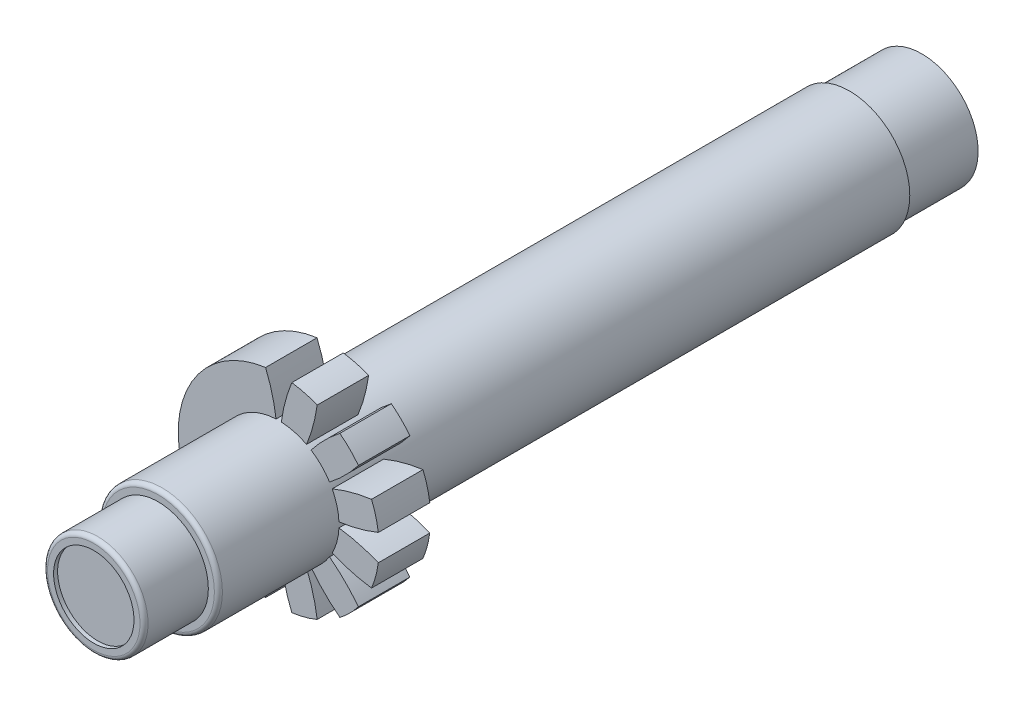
ISO-10303-21;
HEADER;
FILE_DESCRIPTION(('STEP AP214'),'2;1');
FILE_NAME('part.step','',(''),(''),'','','');
FILE_SCHEMA(('AUTOMOTIVE_DESIGN { 1 0 10303 214 1 1 1 1 }'));
ENDSEC;
DATA;
#1=APPLICATION_CONTEXT('core data for automotive mechanical design processes');
#2=APPLICATION_PROTOCOL_DEFINITION('international standard','automotive_design',2000,#1);
#3=PRODUCT_CONTEXT('',#1,'mechanical');
#4=PRODUCT('Part','Part','',(#3));
#5=PRODUCT_RELATED_PRODUCT_CATEGORY('part','',(#4));
#6=PRODUCT_DEFINITION_FORMATION('','',#4);
#7=PRODUCT_DEFINITION_CONTEXT('part definition',#1,'design');
#8=PRODUCT_DEFINITION('design','',#6,#7);
#9=PRODUCT_DEFINITION_SHAPE('','',#8);
#10=(LENGTH_UNIT() NAMED_UNIT(*) SI_UNIT(.MILLI.,.METRE.));
#11=(NAMED_UNIT(*) PLANE_ANGLE_UNIT() SI_UNIT($,.RADIAN.));
#12=(NAMED_UNIT(*) SI_UNIT($,.STERADIAN.) SOLID_ANGLE_UNIT());
#13=UNCERTAINTY_MEASURE_WITH_UNIT(LENGTH_MEASURE(1.E-05),#10,'distance_accuracy_value','');
#14=(GEOMETRIC_REPRESENTATION_CONTEXT(3) GLOBAL_UNCERTAINTY_ASSIGNED_CONTEXT((#13)) GLOBAL_UNIT_ASSIGNED_CONTEXT((#10,
#11,#12)) REPRESENTATION_CONTEXT('',''));
#15=CARTESIAN_POINT('',(0.,0.,0.));
#16=DIRECTION('',(0.,0.,1.));
#17=DIRECTION('',(1.,0.,0.));
#18=AXIS2_PLACEMENT_3D('',#15,#16,#17);
#19=CARTESIAN_POINT('',(0.,0.,-10.8712));
#20=DIRECTION('',(0.,0.,1.));
#21=DIRECTION('',(1.,0.,0.));
#22=AXIS2_PLACEMENT_3D('',#19,#20,#21);
#23=CYLINDRICAL_SURFACE('',#22,6.35);
#24=CARTESIAN_POINT('',(0.,0.,-10.8712));
#25=DIRECTION('',(0.,0.,1.));
#26=DIRECTION('',(1.,0.,0.));
#27=AXIS2_PLACEMENT_3D('',#24,#25,#26);
#28=CIRCLE('',#27,6.35);
#29=CARTESIAN_POINT('',(-0.828844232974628,6.29567448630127,-10.8712));
#30=VERTEX_POINT('',#29);
#31=CARTESIAN_POINT('',(-5.86663390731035,-2.43004250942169,-10.8712));
#32=VERTEX_POINT('',#31);
#33=EDGE_CURVE('E322',#30,#32,#28,.T.);
#34=ORIENTED_EDGE('',*,*,#33,.T.);
#35=DIRECTION('',(0.,0.,1.));
#36=VECTOR('',#35,1.);
#37=CARTESIAN_POINT('',(-5.86663390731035,-2.43004250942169,-48.26));
#38=LINE('',#37,#36);
#39=CARTESIAN_POINT('',(-5.86663390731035,-2.43004250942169,-7.62));
#40=VERTEX_POINT('',#39);
#41=EDGE_CURVE('E293',#32,#40,#38,.T.);
#42=ORIENTED_EDGE('',*,*,#41,.T.);
#43=CARTESIAN_POINT('',(0.,0.,-7.62));
#44=DIRECTION('',(0.,0.,1.));
#45=DIRECTION('',(1.,0.,0.));
#46=AXIS2_PLACEMENT_3D('',#43,#44,#45);
#47=CIRCLE('',#46,6.35);
#48=CARTESIAN_POINT('',(-0.828844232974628,6.29567448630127,-7.62));
#49=VERTEX_POINT('',#48);
#50=EDGE_CURVE('E311',#49,#40,#47,.T.);
#51=ORIENTED_EDGE('',*,*,#50,.F.);
#52=DIRECTION('',(0.,0.,1.));
#53=VECTOR('',#52,1.);
#54=CARTESIAN_POINT('',(-0.828844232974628,6.29567448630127,-48.26));
#55=LINE('',#54,#53);
#56=EDGE_CURVE('E584',#30,#49,#55,.T.);
#57=ORIENTED_EDGE('',*,*,#56,.F.);
#58=EDGE_LOOP('',(#34,#42,#51,#57));
#59=FACE_BOUND('',#58,.T.);
#60=ADVANCED_FACE('F29',(#59),#23,.T.);
#61=CARTESIAN_POINT('',(0.,0.,-10.8712));
#62=DIRECTION('',(0.,0.,1.));
#63=DIRECTION('',(1.,0.,0.));
#64=AXIS2_PLACEMENT_3D('',#61,#62,#63);
#65=PLANE('',#64);
#66=CARTESIAN_POINT('',(-7.20534714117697,7.47994471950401,-10.8712));
#67=DIRECTION('',(0.,0.,1.));
#68=DIRECTION('',(1.,0.,0.));
#69=AXIS2_PLACEMENT_3D('',#66,#67,#68);
#70=CIRCLE('',#69,10.);
#71=CARTESIAN_POINT('',(-3.37951046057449,-1.75926377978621,-10.8712));
#72=VERTEX_POINT('',#71);
#73=EDGE_CURVE('E304',#32,#72,#70,.T.);
#74=ORIENTED_EDGE('',*,*,#73,.F.);
#75=ORIENTED_EDGE('',*,*,#33,.F.);
#76=CARTESIAN_POINT('',(-10.0804980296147,2.500031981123,-10.8712));
#77=DIRECTION('',(0.,0.,1.));
#78=DIRECTION('',(1.,0.,0.));
#79=AXIS2_PLACEMENT_3D('',#76,#77,#78);
#80=CIRCLE('',#79,10.);
#81=CARTESIAN_POINT('',(-0.166191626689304,3.80637364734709,-10.8712));
#82=VERTEX_POINT('',#81);
#83=EDGE_CURVE('E320',#30,#82,#80,.F.);
#84=ORIENTED_EDGE('',*,*,#83,.T.);
#85=CARTESIAN_POINT('',(0.,0.,-10.8712));
#86=DIRECTION('',(0.,0.,1.));
#87=DIRECTION('',(1.,0.,0.));
#88=AXIS2_PLACEMENT_3D('',#85,#86,#87);
#89=CIRCLE('',#88,3.81);
#90=EDGE_CURVE('E325',#72,#82,#89,.F.);
#91=ORIENTED_EDGE('',*,*,#90,.F.);
#92=EDGE_LOOP('',(#74,#75,#84,#91));
#93=FACE_BOUND('',#92,.T.);
#94=ADVANCED_FACE('F414',(#93),#65,.F.);
#95=CARTESIAN_POINT('',(0.,0.,-7.62));
#96=DIRECTION('',(0.,0.,1.));
#97=DIRECTION('',(1.,0.,0.));
#98=AXIS2_PLACEMENT_3D('',#95,#96,#97);
#99=PLANE('',#98);
#100=ORIENTED_EDGE('',*,*,#50,.T.);
#101=CARTESIAN_POINT('',(-7.20534714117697,7.47994471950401,-7.62));
#102=DIRECTION('',(0.,0.,1.));
#103=DIRECTION('',(-0.499999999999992,0.866025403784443,0.));
#104=AXIS2_PLACEMENT_3D('',#101,#102,#103);
#105=CIRCLE('',#104,10.);
#106=CARTESIAN_POINT('',(-3.37951046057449,-1.75926377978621,-7.62));
#107=VERTEX_POINT('',#106);
#108=EDGE_CURVE('E728',#40,#107,#105,.T.);
#109=ORIENTED_EDGE('',*,*,#108,.T.);
#110=CARTESIAN_POINT('',(0.,0.,-7.62));
#111=DIRECTION('',(0.,0.,1.));
#112=DIRECTION('',(1.,0.,0.));
#113=AXIS2_PLACEMENT_3D('',#110,#111,#112);
#114=CIRCLE('',#113,3.81);
#115=CARTESIAN_POINT('',(-0.166191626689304,3.80637364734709,-7.62));
#116=VERTEX_POINT('',#115);
#117=EDGE_CURVE('E39',#107,#116,#114,.F.);
#118=ORIENTED_EDGE('',*,*,#117,.T.);
#119=CARTESIAN_POINT('',(-10.0804980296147,2.500031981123,-7.62));
#120=DIRECTION('',(0.,0.,-1.));
#121=DIRECTION('',(-1.,0.,0.));
#122=AXIS2_PLACEMENT_3D('',#119,#120,#121);
#123=CIRCLE('',#122,10.);
#124=EDGE_CURVE('E597',#49,#116,#123,.T.);
#125=ORIENTED_EDGE('',*,*,#124,.F.);
#126=EDGE_LOOP('',(#100,#109,#118,#125));
#127=FACE_BOUND('',#126,.T.);
#128=ADVANCED_FACE('F421',(#127),#99,.T.);
#129=DIRECTION('',(0.,0.,1.));
#130=VECTOR('',#129,1.);
#131=CARTESIAN_POINT('',(-5.03779192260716,-3.86563740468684,-48.26));
#132=LINE('',#131,#130);
#133=CARTESIAN_POINT('',(-5.03779192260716,-3.86563740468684,-10.8712));
#134=VERTEX_POINT('',#133);
#135=CARTESIAN_POINT('',(-5.03779192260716,-3.86563740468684,-7.62));
#136=VERTEX_POINT('',#135);
#137=EDGE_CURVE('E286',#134,#136,#132,.T.);
#138=ORIENTED_EDGE('',*,*,#137,.F.);
#139=CARTESIAN_POINT('',(-3.86563274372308,-5.03779549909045,-10.8712));
#140=VERTEX_POINT('',#139);
#141=EDGE_CURVE('E326',#134,#140,#28,.T.);
#142=ORIENTED_EDGE('',*,*,#141,.T.);
#143=DIRECTION('',(0.,0.,1.));
#144=VECTOR('',#143,1.);
#145=CARTESIAN_POINT('',(-3.86563274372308,-5.03779549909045,-48.26));
#146=LINE('',#145,#144);
#147=CARTESIAN_POINT('',(-3.86563274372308,-5.03779549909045,-7.62));
#148=VERTEX_POINT('',#147);
#149=EDGE_CURVE('E310',#140,#148,#146,.T.);
#150=ORIENTED_EDGE('',*,*,#149,.T.);
#151=EDGE_CURVE('E300',#136,#148,#47,.T.);
#152=ORIENTED_EDGE('',*,*,#151,.F.);
#153=EDGE_LOOP('',(#138,#142,#150,#152));
#154=FACE_BOUND('',#153,.T.);
#155=ADVANCED_FACE('F308',(#154),#23,.T.);
#156=ORIENTED_EDGE('',*,*,#141,.F.);
#157=CARTESIAN_POINT('',(2.87515780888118,-9.97998336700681,-10.8712));
#158=DIRECTION('',(0.,0.,1.));
#159=DIRECTION('',(1.,0.,0.));
#160=AXIS2_PLACEMENT_3D('',#157,#158,#159);
#161=CIRCLE('',#160,10.);
#162=CARTESIAN_POINT('',(-3.21332046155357,-2.04711299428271,-10.8712));
#163=VERTEX_POINT('',#162);
#164=EDGE_CURVE('E289',#134,#163,#161,.F.);
#165=ORIENTED_EDGE('',*,*,#164,.T.);
#166=CARTESIAN_POINT('',(-2.04711002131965,-3.21332235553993,-10.8712));
#167=VERTEX_POINT('',#166);
#168=EDGE_CURVE('E746',#167,#163,#89,.F.);
#169=ORIENTED_EDGE('',*,*,#168,.F.);
#170=CARTESIAN_POINT('',(-9.97998602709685,2.87514857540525,-10.8712));
#171=DIRECTION('',(0.,0.,1.));
#172=DIRECTION('',(1.,0.,0.));
#173=AXIS2_PLACEMENT_3D('',#170,#171,#172);
#174=CIRCLE('',#173,10.);
#175=EDGE_CURVE('E538',#140,#167,#174,.T.);
#176=ORIENTED_EDGE('',*,*,#175,.F.);
#177=EDGE_LOOP('',(#156,#165,#169,#176));
#178=FACE_BOUND('',#177,.T.);
#179=ADVANCED_FACE('F424',(#178),#65,.F.);
#180=CARTESIAN_POINT('',(2.87515780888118,-9.97998336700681,-7.62));
#181=DIRECTION('',(0.,0.,-1.));
#182=DIRECTION('',(0.499999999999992,-0.866025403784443,0.));
#183=AXIS2_PLACEMENT_3D('',#180,#181,#182);
#184=CIRCLE('',#183,10.);
#185=CARTESIAN_POINT('',(-3.21332046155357,-2.04711299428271,-7.62));
#186=VERTEX_POINT('',#185);
#187=EDGE_CURVE('E46',#136,#186,#184,.T.);
#188=ORIENTED_EDGE('',*,*,#187,.F.);
#189=ORIENTED_EDGE('',*,*,#151,.T.);
#190=CARTESIAN_POINT('',(-9.97998602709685,2.87514857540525,-7.62));
#191=DIRECTION('',(0.,0.,1.));
#192=DIRECTION('',(-0.866025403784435,0.500000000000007,0.));
#193=AXIS2_PLACEMENT_3D('',#190,#191,#192);
#194=CIRCLE('',#193,10.);
#195=CARTESIAN_POINT('',(-2.04711002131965,-3.21332235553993,-7.62));
#196=VERTEX_POINT('',#195);
#197=EDGE_CURVE('E723',#148,#196,#194,.T.);
#198=ORIENTED_EDGE('',*,*,#197,.T.);
#199=EDGE_CURVE('E303',#196,#186,#114,.F.);
#200=ORIENTED_EDGE('',*,*,#199,.T.);
#201=EDGE_LOOP('',(#188,#189,#198,#200));
#202=FACE_BOUND('',#201,.T.);
#203=ADVANCED_FACE('F298',(#202),#99,.T.);
#204=DIRECTION('',(0.,0.,1.));
#205=VECTOR('',#204,1.);
#206=CARTESIAN_POINT('',(-2.43003708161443,-5.86663615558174,-48.26));
#207=LINE('',#206,#205);
#208=CARTESIAN_POINT('',(-2.43003708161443,-5.86663615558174,-10.8712));
#209=VERTEX_POINT('',#208);
#210=CARTESIAN_POINT('',(-2.43003708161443,-5.86663615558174,-7.62));
#211=VERTEX_POINT('',#210);
#212=EDGE_CURVE('E716',#209,#211,#207,.T.);
#213=ORIENTED_EDGE('',*,*,#212,.F.);
#214=CARTESIAN_POINT('',(-0.828838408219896,-6.29567525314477,-10.8712));
#215=VERTEX_POINT('',#214);
#216=EDGE_CURVE('E539',#209,#215,#28,.T.);
#217=ORIENTED_EDGE('',*,*,#216,.T.);
#218=DIRECTION('',(0.,0.,1.));
#219=VECTOR('',#218,1.);
#220=CARTESIAN_POINT('',(-0.828838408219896,-6.29567525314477,-48.26));
#221=LINE('',#220,#219);
#222=CARTESIAN_POINT('',(-0.828838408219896,-6.29567525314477,-7.62));
#223=VERTEX_POINT('',#222);
#224=EDGE_CURVE('E700',#215,#223,#221,.T.);
#225=ORIENTED_EDGE('',*,*,#224,.T.);
#226=EDGE_CURVE('E312',#211,#223,#47,.T.);
#227=ORIENTED_EDGE('',*,*,#226,.F.);
#228=EDGE_LOOP('',(#213,#217,#225,#227));
#229=FACE_BOUND('',#228,.T.);
#230=ADVANCED_FACE('F428',(#229),#23,.T.);
#231=ORIENTED_EDGE('',*,*,#216,.F.);
#232=CARTESIAN_POINT('',(7.47995138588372,-7.20534022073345,-10.8712));
#233=DIRECTION('',(0.,0.,1.));
#234=DIRECTION('',(1.,0.,0.));
#235=AXIS2_PLACEMENT_3D('',#232,#233,#234);
#236=CIRCLE('',#235,10.);
#237=CARTESIAN_POINT('',(-1.75926065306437,-3.37951208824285,-10.8712));
#238=VERTEX_POINT('',#237);
#239=EDGE_CURVE('E712',#209,#238,#236,.F.);
#240=ORIENTED_EDGE('',*,*,#239,.T.);
#241=CARTESIAN_POINT('',(-0.166188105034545,-3.80637380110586,-10.8712));
#242=VERTEX_POINT('',#241);
#243=EDGE_CURVE('E747',#242,#238,#89,.F.);
#244=ORIENTED_EDGE('',*,*,#243,.F.);
#245=CARTESIAN_POINT('',(-10.0804957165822,-2.50004130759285,-10.8712));
#246=DIRECTION('',(0.,0.,1.));
#247=DIRECTION('',(1.,0.,0.));
#248=AXIS2_PLACEMENT_3D('',#245,#246,#247);
#249=CIRCLE('',#248,10.);
#250=EDGE_CURVE('E696',#215,#242,#249,.T.);
#251=ORIENTED_EDGE('',*,*,#250,.F.);
#252=EDGE_LOOP('',(#231,#240,#244,#251));
#253=FACE_BOUND('',#252,.T.);
#254=ADVANCED_FACE('F516',(#253),#65,.F.);
#255=CARTESIAN_POINT('',(7.47995138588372,-7.20534022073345,-7.62));
#256=DIRECTION('',(0.,0.,-1.));
#257=DIRECTION('',(0.866025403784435,-0.500000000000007,0.));
#258=AXIS2_PLACEMENT_3D('',#255,#256,#257);
#259=CIRCLE('',#258,10.);
#260=CARTESIAN_POINT('',(-1.75926065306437,-3.37951208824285,-7.62));
#261=VERTEX_POINT('',#260);
#262=EDGE_CURVE('E54',#211,#261,#259,.T.);
#263=ORIENTED_EDGE('',*,*,#262,.F.);
#264=ORIENTED_EDGE('',*,*,#226,.T.);
#265=CARTESIAN_POINT('',(-10.0804957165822,-2.50004130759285,-7.62));
#266=DIRECTION('',(0.,0.,1.));
#267=DIRECTION('',(-1.,0.,0.));
#268=AXIS2_PLACEMENT_3D('',#265,#266,#267);
#269=CIRCLE('',#268,10.);
#270=CARTESIAN_POINT('',(-0.166188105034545,-3.80637380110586,-7.62));
#271=VERTEX_POINT('',#270);
#272=EDGE_CURVE('E707',#223,#271,#269,.T.);
#273=ORIENTED_EDGE('',*,*,#272,.T.);
#274=EDGE_CURVE('E928',#271,#261,#114,.F.);
#275=ORIENTED_EDGE('',*,*,#274,.T.);
#276=EDGE_LOOP('',(#263,#264,#273,#275));
#277=FACE_BOUND('',#276,.T.);
#278=ADVANCED_FACE('F508',(#277),#99,.T.);
#279=DIRECTION('',(0.,0.,1.));
#280=VECTOR('',#279,1.);
#281=CARTESIAN_POINT('',(0.828844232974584,-6.29567448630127,-48.26));
#282=LINE('',#281,#280);
#283=CARTESIAN_POINT('',(0.828844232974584,-6.29567448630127,-10.8712));
#284=VERTEX_POINT('',#283);
#285=CARTESIAN_POINT('',(0.828844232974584,-6.29567448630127,-7.62));
#286=VERTEX_POINT('',#285);
#287=EDGE_CURVE('E698',#284,#286,#282,.T.);
#288=ORIENTED_EDGE('',*,*,#287,.F.);
#289=CARTESIAN_POINT('',(2.43004250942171,-5.86663390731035,-10.8712));
#290=VERTEX_POINT('',#289);
#291=EDGE_CURVE('E540',#284,#290,#28,.T.);
#292=ORIENTED_EDGE('',*,*,#291,.T.);
#293=DIRECTION('',(0.,0.,1.));
#294=VECTOR('',#293,1.);
#295=CARTESIAN_POINT('',(2.43004250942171,-5.86663390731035,-48.26));
#296=LINE('',#295,#294);
#297=CARTESIAN_POINT('',(2.43004250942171,-5.86663390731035,-7.62));
#298=VERTEX_POINT('',#297);
#299=EDGE_CURVE('E685',#290,#298,#296,.T.);
#300=ORIENTED_EDGE('',*,*,#299,.T.);
#301=EDGE_CURVE('E317',#286,#298,#47,.T.);
#302=ORIENTED_EDGE('',*,*,#301,.F.);
#303=EDGE_LOOP('',(#288,#292,#300,#302));
#304=FACE_BOUND('',#303,.T.);
#305=ADVANCED_FACE('F514',(#304),#23,.T.);
#306=ORIENTED_EDGE('',*,*,#291,.F.);
#307=CARTESIAN_POINT('',(10.0804980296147,-2.50003198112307,-10.8712));
#308=DIRECTION('',(0.,0.,1.));
#309=DIRECTION('',(1.,0.,0.));
#310=AXIS2_PLACEMENT_3D('',#307,#308,#309);
#311=CIRCLE('',#310,10.);
#312=CARTESIAN_POINT('',(0.166191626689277,-3.80637364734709,-10.8712));
#313=VERTEX_POINT('',#312);
#314=EDGE_CURVE('E690',#284,#313,#311,.F.);
#315=ORIENTED_EDGE('',*,*,#314,.T.);
#316=CARTESIAN_POINT('',(1.75926377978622,-3.37951046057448,-10.8712));
#317=VERTEX_POINT('',#316);
#318=EDGE_CURVE('E766',#317,#313,#89,.F.);
#319=ORIENTED_EDGE('',*,*,#318,.F.);
#320=CARTESIAN_POINT('',(-7.47994471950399,-7.20534714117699,-10.8712));
#321=DIRECTION('',(0.,0.,1.));
#322=DIRECTION('',(1.,0.,0.));
#323=AXIS2_PLACEMENT_3D('',#320,#321,#322);
#324=CIRCLE('',#323,10.);
#325=EDGE_CURVE('E677',#290,#317,#324,.T.);
#326=ORIENTED_EDGE('',*,*,#325,.F.);
#327=EDGE_LOOP('',(#306,#315,#319,#326));
#328=FACE_BOUND('',#327,.T.);
#329=ADVANCED_FACE('F504',(#328),#65,.F.);
#330=CARTESIAN_POINT('',(10.0804980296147,-2.50003198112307,-7.62));
#331=DIRECTION('',(0.,0.,-1.));
#332=DIRECTION('',(1.,0.,0.));
#333=AXIS2_PLACEMENT_3D('',#330,#331,#332);
#334=CIRCLE('',#333,10.);
#335=CARTESIAN_POINT('',(0.166191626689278,-3.80637364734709,-7.62));
#336=VERTEX_POINT('',#335);
#337=EDGE_CURVE('E710',#286,#336,#334,.T.);
#338=ORIENTED_EDGE('',*,*,#337,.F.);
#339=ORIENTED_EDGE('',*,*,#301,.T.);
#340=CARTESIAN_POINT('',(-7.47994471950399,-7.20534714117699,-7.62));
#341=DIRECTION('',(0.,0.,1.));
#342=DIRECTION('',(-0.866025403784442,-0.499999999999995,0.));
#343=AXIS2_PLACEMENT_3D('',#340,#341,#342);
#344=CIRCLE('',#343,10.);
#345=CARTESIAN_POINT('',(1.75926377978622,-3.37951046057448,-7.62));
#346=VERTEX_POINT('',#345);
#347=EDGE_CURVE('E682',#298,#346,#344,.T.);
#348=ORIENTED_EDGE('',*,*,#347,.T.);
#349=EDGE_CURVE('E929',#346,#336,#114,.F.);
#350=ORIENTED_EDGE('',*,*,#349,.T.);
#351=EDGE_LOOP('',(#338,#339,#348,#350));
#352=FACE_BOUND('',#351,.T.);
#353=ADVANCED_FACE('F496',(#352),#99,.T.);
#354=DIRECTION('',(0.,0.,1.));
#355=VECTOR('',#354,1.);
#356=CARTESIAN_POINT('',(3.86563740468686,-5.03779192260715,-48.26));
#357=LINE('',#356,#355);
#358=CARTESIAN_POINT('',(3.86563740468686,-5.03779192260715,-10.8712));
#359=VERTEX_POINT('',#358);
#360=CARTESIAN_POINT('',(3.86563740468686,-5.03779192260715,-7.62));
#361=VERTEX_POINT('',#360);
#362=EDGE_CURVE('E689',#359,#361,#357,.T.);
#363=ORIENTED_EDGE('',*,*,#362,.F.);
#364=CARTESIAN_POINT('',(5.03779549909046,-3.86563274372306,-10.8712));
#365=VERTEX_POINT('',#364);
#366=EDGE_CURVE('E545',#359,#365,#28,.T.);
#367=ORIENTED_EDGE('',*,*,#366,.T.);
#368=DIRECTION('',(0.,0.,1.));
#369=VECTOR('',#368,1.);
#370=CARTESIAN_POINT('',(5.03779549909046,-3.86563274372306,-48.26));
#371=LINE('',#370,#369);
#372=CARTESIAN_POINT('',(5.03779549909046,-3.86563274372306,-7.62));
#373=VERTEX_POINT('',#372);
#374=EDGE_CURVE('E662',#365,#373,#371,.T.);
#375=ORIENTED_EDGE('',*,*,#374,.T.);
#376=EDGE_CURVE('E1292',#361,#373,#47,.T.);
#377=ORIENTED_EDGE('',*,*,#376,.F.);
#378=EDGE_LOOP('',(#363,#367,#375,#377));
#379=FACE_BOUND('',#378,.T.);
#380=ADVANCED_FACE('F502',(#379),#23,.T.);
#381=ORIENTED_EDGE('',*,*,#366,.F.);
#382=CARTESIAN_POINT('',(9.9799833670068,2.87515780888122,-10.8712));
#383=DIRECTION('',(0.,0.,1.));
#384=DIRECTION('',(1.,0.,0.));
#385=AXIS2_PLACEMENT_3D('',#382,#383,#384);
#386=CIRCLE('',#385,10.);
#387=CARTESIAN_POINT('',(2.04711299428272,-3.21332046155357,-10.8712));
#388=VERTEX_POINT('',#387);
#389=EDGE_CURVE('E674',#359,#388,#386,.F.);
#390=ORIENTED_EDGE('',*,*,#389,.T.);
#391=CARTESIAN_POINT('',(3.21332235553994,-2.04711002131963,-10.8712));
#392=VERTEX_POINT('',#391);
#393=EDGE_CURVE('E761',#392,#388,#89,.F.);
#394=ORIENTED_EDGE('',*,*,#393,.F.);
#395=CARTESIAN_POINT('',(-2.87514857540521,-9.97998602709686,-10.8712));
#396=DIRECTION('',(0.,0.,1.));
#397=DIRECTION('',(1.,0.,0.));
#398=AXIS2_PLACEMENT_3D('',#395,#396,#397);
#399=CIRCLE('',#398,10.);
#400=EDGE_CURVE('E658',#365,#392,#399,.T.);
#401=ORIENTED_EDGE('',*,*,#400,.F.);
#402=EDGE_LOOP('',(#381,#390,#394,#401));
#403=FACE_BOUND('',#402,.T.);
#404=ADVANCED_FACE('F492',(#403),#65,.F.);
#405=CARTESIAN_POINT('',(9.9799833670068,2.87515780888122,-7.62));
#406=DIRECTION('',(0.,0.,-1.));
#407=DIRECTION('',(0.866025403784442,0.499999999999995,0.));
#408=AXIS2_PLACEMENT_3D('',#405,#406,#407);
#409=CIRCLE('',#408,10.);
#410=CARTESIAN_POINT('',(2.04711299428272,-3.21332046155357,-7.62));
#411=VERTEX_POINT('',#410);
#412=EDGE_CURVE('E679',#361,#411,#409,.T.);
#413=ORIENTED_EDGE('',*,*,#412,.F.);
#414=ORIENTED_EDGE('',*,*,#376,.T.);
#415=CARTESIAN_POINT('',(-2.87514857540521,-9.97998602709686,-7.62));
#416=DIRECTION('',(0.,0.,1.));
#417=DIRECTION('',(-0.500000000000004,-0.866025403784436,0.));
#418=AXIS2_PLACEMENT_3D('',#415,#416,#417);
#419=CIRCLE('',#418,10.);
#420=CARTESIAN_POINT('',(3.21332235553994,-2.04711002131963,-7.62));
#421=VERTEX_POINT('',#420);
#422=EDGE_CURVE('E669',#373,#421,#419,.T.);
#423=ORIENTED_EDGE('',*,*,#422,.T.);
#424=EDGE_CURVE('E931',#421,#411,#114,.F.);
#425=ORIENTED_EDGE('',*,*,#424,.T.);
#426=EDGE_LOOP('',(#413,#414,#423,#425));
#427=FACE_BOUND('',#426,.T.);
#428=ADVANCED_FACE('F484',(#427),#99,.T.);
#429=DIRECTION('',(0.,0.,1.));
#430=VECTOR('',#429,1.);
#431=CARTESIAN_POINT('',(5.86663615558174,-2.4300370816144,-48.26));
#432=LINE('',#431,#430);
#433=CARTESIAN_POINT('',(5.86663615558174,-2.4300370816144,-10.8712));
#434=VERTEX_POINT('',#433);
#435=CARTESIAN_POINT('',(5.86663615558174,-2.4300370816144,-7.62));
#436=VERTEX_POINT('',#435);
#437=EDGE_CURVE('E660',#434,#436,#432,.T.);
#438=ORIENTED_EDGE('',*,*,#437,.F.);
#439=CARTESIAN_POINT('',(6.29567525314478,-0.828838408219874,-10.8712));
#440=VERTEX_POINT('',#439);
#441=EDGE_CURVE('E550',#434,#440,#28,.T.);
#442=ORIENTED_EDGE('',*,*,#441,.T.);
#443=DIRECTION('',(0.,0.,1.));
#444=VECTOR('',#443,1.);
#445=CARTESIAN_POINT('',(6.29567525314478,-0.828838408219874,-48.26));
#446=LINE('',#445,#444);
#447=CARTESIAN_POINT('',(6.29567525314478,-0.828838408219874,-7.62));
#448=VERTEX_POINT('',#447);
#449=EDGE_CURVE('E643',#440,#448,#446,.T.);
#450=ORIENTED_EDGE('',*,*,#449,.T.);
#451=EDGE_CURVE('E948',#436,#448,#47,.T.);
#452=ORIENTED_EDGE('',*,*,#451,.F.);
#453=EDGE_LOOP('',(#438,#442,#450,#452));
#454=FACE_BOUND('',#453,.T.);
#455=ADVANCED_FACE('F490',(#454),#23,.T.);
#456=ORIENTED_EDGE('',*,*,#441,.F.);
#457=CARTESIAN_POINT('',(7.20534022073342,7.47995138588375,-10.8712));
#458=DIRECTION('',(0.,0.,1.));
#459=DIRECTION('',(1.,0.,0.));
#460=AXIS2_PLACEMENT_3D('',#457,#458,#459);
#461=CIRCLE('',#460,10.);
#462=CARTESIAN_POINT('',(3.37951208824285,-1.75926065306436,-10.8712));
#463=VERTEX_POINT('',#462);
#464=EDGE_CURVE('E655',#434,#463,#461,.F.);
#465=ORIENTED_EDGE('',*,*,#464,.T.);
#466=CARTESIAN_POINT('',(3.80637380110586,-0.166188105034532,-10.8712));
#467=VERTEX_POINT('',#466);
#468=EDGE_CURVE('E756',#467,#463,#89,.F.);
#469=ORIENTED_EDGE('',*,*,#468,.F.);
#470=CARTESIAN_POINT('',(2.50004130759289,-10.0804957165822,-10.8712));
#471=DIRECTION('',(0.,0.,1.));
#472=DIRECTION('',(1.,0.,0.));
#473=AXIS2_PLACEMENT_3D('',#470,#471,#472);
#474=CIRCLE('',#473,10.);
#475=EDGE_CURVE('E639',#440,#467,#474,.T.);
#476=ORIENTED_EDGE('',*,*,#475,.F.);
#477=EDGE_LOOP('',(#456,#465,#469,#476));
#478=FACE_BOUND('',#477,.T.);
#479=ADVANCED_FACE('F480',(#478),#65,.F.);
#480=CARTESIAN_POINT('',(7.20534022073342,7.47995138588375,-7.62));
#481=DIRECTION('',(0.,0.,-1.));
#482=DIRECTION('',(0.500000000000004,0.866025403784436,0.));
#483=AXIS2_PLACEMENT_3D('',#480,#481,#482);
#484=CIRCLE('',#483,10.);
#485=CARTESIAN_POINT('',(3.37951208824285,-1.75926065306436,-7.62));
#486=VERTEX_POINT('',#485);
#487=EDGE_CURVE('E672',#436,#486,#484,.T.);
#488=ORIENTED_EDGE('',*,*,#487,.F.);
#489=ORIENTED_EDGE('',*,*,#451,.T.);
#490=CARTESIAN_POINT('',(2.50004130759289,-10.0804957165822,-7.62));
#491=DIRECTION('',(0.,0.,1.));
#492=DIRECTION('',(0.,-1.,0.));
#493=AXIS2_PLACEMENT_3D('',#490,#491,#492);
#494=CIRCLE('',#493,10.);
#495=CARTESIAN_POINT('',(3.80637380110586,-0.166188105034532,-7.62));
#496=VERTEX_POINT('',#495);
#497=EDGE_CURVE('E650',#448,#496,#494,.T.);
#498=ORIENTED_EDGE('',*,*,#497,.T.);
#499=EDGE_CURVE('E934',#496,#486,#114,.F.);
#500=ORIENTED_EDGE('',*,*,#499,.T.);
#501=EDGE_LOOP('',(#488,#489,#498,#500));
#502=FACE_BOUND('',#501,.T.);
#503=ADVANCED_FACE('F475',(#502),#99,.T.);
#504=DIRECTION('',(0.,0.,1.));
#505=VECTOR('',#504,1.);
#506=CARTESIAN_POINT('',(6.29567448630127,0.828844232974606,-48.26));
#507=LINE('',#506,#505);
#508=CARTESIAN_POINT('',(6.29567448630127,0.828844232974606,-10.8712));
#509=VERTEX_POINT('',#508);
#510=CARTESIAN_POINT('',(6.29567448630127,0.828844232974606,-7.62));
#511=VERTEX_POINT('',#510);
#512=EDGE_CURVE('E641',#509,#511,#507,.T.);
#513=ORIENTED_EDGE('',*,*,#512,.F.);
#514=CARTESIAN_POINT('',(5.86663390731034,2.43004250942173,-10.8712));
#515=VERTEX_POINT('',#514);
#516=EDGE_CURVE('E555',#509,#515,#28,.T.);
#517=ORIENTED_EDGE('',*,*,#516,.T.);
#518=DIRECTION('',(0.,0.,1.));
#519=VECTOR('',#518,1.);
#520=CARTESIAN_POINT('',(5.86663390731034,2.43004250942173,-48.26));
#521=LINE('',#520,#519);
#522=CARTESIAN_POINT('',(5.86663390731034,2.43004250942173,-7.62));
#523=VERTEX_POINT('',#522);
#524=EDGE_CURVE('E628',#515,#523,#521,.T.);
#525=ORIENTED_EDGE('',*,*,#524,.T.);
#526=EDGE_CURVE('E947',#511,#523,#47,.T.);
#527=ORIENTED_EDGE('',*,*,#526,.F.);
#528=EDGE_LOOP('',(#513,#517,#525,#527));
#529=FACE_BOUND('',#528,.T.);
#530=ADVANCED_FACE('F447',(#529),#23,.T.);
#531=ORIENTED_EDGE('',*,*,#516,.F.);
#532=CARTESIAN_POINT('',(2.50003198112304,10.0804980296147,-10.8712));
#533=DIRECTION('',(0.,0.,1.));
#534=DIRECTION('',(1.,0.,0.));
#535=AXIS2_PLACEMENT_3D('',#532,#533,#534);
#536=CIRCLE('',#535,10.);
#537=CARTESIAN_POINT('',(3.80637364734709,0.166191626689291,-10.8712));
#538=VERTEX_POINT('',#537);
#539=EDGE_CURVE('E633',#509,#538,#536,.F.);
#540=ORIENTED_EDGE('',*,*,#539,.T.);
#541=CARTESIAN_POINT('',(3.37951046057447,1.75926377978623,-10.8712));
#542=VERTEX_POINT('',#541);
#543=EDGE_CURVE('E751',#542,#538,#89,.F.);
#544=ORIENTED_EDGE('',*,*,#543,.F.);
#545=CARTESIAN_POINT('',(7.20534714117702,-7.47994471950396,-10.8712));
#546=DIRECTION('',(0.,0.,1.));
#547=DIRECTION('',(1.,0.,0.));
#548=AXIS2_PLACEMENT_3D('',#545,#546,#547);
#549=CIRCLE('',#548,10.);
#550=EDGE_CURVE('E620',#515,#542,#549,.T.);
#551=ORIENTED_EDGE('',*,*,#550,.F.);
#552=EDGE_LOOP('',(#531,#540,#544,#551));
#553=FACE_BOUND('',#552,.T.);
#554=ADVANCED_FACE('F471',(#553),#65,.F.);
#555=CARTESIAN_POINT('',(2.50003198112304,10.0804980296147,-7.62));
#556=DIRECTION('',(0.,0.,-1.));
#557=DIRECTION('',(0.,1.,0.));
#558=AXIS2_PLACEMENT_3D('',#555,#556,#557);
#559=CIRCLE('',#558,10.);
#560=CARTESIAN_POINT('',(3.80637364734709,0.166191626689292,-7.62));
#561=VERTEX_POINT('',#560);
#562=EDGE_CURVE('E653',#511,#561,#559,.T.);
#563=ORIENTED_EDGE('',*,*,#562,.F.);
#564=ORIENTED_EDGE('',*,*,#526,.T.);
#565=CARTESIAN_POINT('',(7.20534714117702,-7.47994471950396,-7.62));
#566=DIRECTION('',(0.,0.,1.));
#567=DIRECTION('',(0.499999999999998,-0.86602540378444,0.));
#568=AXIS2_PLACEMENT_3D('',#565,#566,#567);
#569=CIRCLE('',#568,10.);
#570=CARTESIAN_POINT('',(3.37951046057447,1.75926377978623,-7.62));
#571=VERTEX_POINT('',#570);
#572=EDGE_CURVE('E625',#523,#571,#569,.T.);
#573=ORIENTED_EDGE('',*,*,#572,.T.);
#574=EDGE_CURVE('E937',#571,#561,#114,.F.);
#575=ORIENTED_EDGE('',*,*,#574,.T.);
#576=EDGE_LOOP('',(#563,#564,#573,#575));
#577=FACE_BOUND('',#576,.T.);
#578=ADVANCED_FACE('F445',(#577),#99,.T.);
#579=DIRECTION('',(0.,0.,1.));
#580=VECTOR('',#579,1.);
#581=CARTESIAN_POINT('',(5.03779192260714,3.86563740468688,-48.26));
#582=LINE('',#581,#580);
#583=CARTESIAN_POINT('',(5.03779192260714,3.86563740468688,-10.8712));
#584=VERTEX_POINT('',#583);
#585=CARTESIAN_POINT('',(5.03779192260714,3.86563740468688,-7.62));
#586=VERTEX_POINT('',#585);
#587=EDGE_CURVE('E632',#584,#586,#582,.T.);
#588=ORIENTED_EDGE('',*,*,#587,.F.);
#589=CARTESIAN_POINT('',(3.86563274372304,5.03779549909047,-10.8712));
#590=VERTEX_POINT('',#589);
#591=EDGE_CURVE('E560',#584,#590,#28,.T.);
#592=ORIENTED_EDGE('',*,*,#591,.T.);
#593=DIRECTION('',(0.,0.,1.));
#594=VECTOR('',#593,1.);
#595=CARTESIAN_POINT('',(3.86563274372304,5.03779549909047,-48.26));
#596=LINE('',#595,#594);
#597=CARTESIAN_POINT('',(3.86563274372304,5.03779549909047,-7.62));
#598=VERTEX_POINT('',#597);
#599=EDGE_CURVE('E605',#590,#598,#596,.T.);
#600=ORIENTED_EDGE('',*,*,#599,.T.);
#601=EDGE_CURVE('E946',#586,#598,#47,.T.);
#602=ORIENTED_EDGE('',*,*,#601,.F.);
#603=EDGE_LOOP('',(#588,#592,#600,#602));
#604=FACE_BOUND('',#603,.T.);
#605=ADVANCED_FACE('F432',(#604),#23,.T.);
#606=ORIENTED_EDGE('',*,*,#591,.F.);
#607=CARTESIAN_POINT('',(-2.87515780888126,9.97998336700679,-10.8712));
#608=DIRECTION('',(0.,0.,1.));
#609=DIRECTION('',(1.,0.,0.));
#610=AXIS2_PLACEMENT_3D('',#607,#608,#609);
#611=CIRCLE('',#610,10.);
#612=CARTESIAN_POINT('',(3.21332046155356,2.04711299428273,-10.8712));
#613=VERTEX_POINT('',#612);
#614=EDGE_CURVE('E617',#584,#613,#611,.F.);
#615=ORIENTED_EDGE('',*,*,#614,.T.);
#616=CARTESIAN_POINT('',(2.04711002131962,3.21332235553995,-10.8712));
#617=VERTEX_POINT('',#616);
#618=EDGE_CURVE('E748',#617,#613,#89,.F.);
#619=ORIENTED_EDGE('',*,*,#618,.F.);
#620=CARTESIAN_POINT('',(9.97998602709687,-2.87514857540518,-10.8712));
#621=DIRECTION('',(0.,0.,1.));
#622=DIRECTION('',(1.,0.,0.));
#623=AXIS2_PLACEMENT_3D('',#620,#621,#622);
#624=CIRCLE('',#623,10.);
#625=EDGE_CURVE('E602',#590,#617,#624,.T.);
#626=ORIENTED_EDGE('',*,*,#625,.F.);
#627=EDGE_LOOP('',(#606,#615,#619,#626));
#628=FACE_BOUND('',#627,.T.);
#629=ADVANCED_FACE('F439',(#628),#65,.F.);
#630=CARTESIAN_POINT('',(-2.87515780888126,9.97998336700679,-7.62));
#631=DIRECTION('',(0.,0.,-1.));
#632=DIRECTION('',(-0.499999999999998,0.86602540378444,0.));
#633=AXIS2_PLACEMENT_3D('',#630,#631,#632);
#634=CIRCLE('',#633,10.);
#635=CARTESIAN_POINT('',(3.21332046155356,2.04711299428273,-7.62));
#636=VERTEX_POINT('',#635);
#637=EDGE_CURVE('E622',#586,#636,#634,.T.);
#638=ORIENTED_EDGE('',*,*,#637,.F.);
#639=ORIENTED_EDGE('',*,*,#601,.T.);
#640=CARTESIAN_POINT('',(9.97998602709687,-2.87514857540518,-7.62));
#641=DIRECTION('',(0.,0.,1.));
#642=DIRECTION('',(0.866025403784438,-0.500000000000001,0.));
#643=AXIS2_PLACEMENT_3D('',#640,#641,#642);
#644=CIRCLE('',#643,10.);
#645=CARTESIAN_POINT('',(2.04711002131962,3.21332235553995,-7.62));
#646=VERTEX_POINT('',#645);
#647=EDGE_CURVE('E612',#598,#646,#644,.T.);
#648=ORIENTED_EDGE('',*,*,#647,.T.);
#649=EDGE_CURVE('E38',#646,#636,#114,.F.);
#650=ORIENTED_EDGE('',*,*,#649,.T.);
#651=EDGE_LOOP('',(#638,#639,#648,#650));
#652=FACE_BOUND('',#651,.T.);
#653=ADVANCED_FACE('F452',(#652),#99,.T.);
#654=CARTESIAN_POINT('',(0.,0.,-48.26));
#655=DIRECTION('',(0.,0.,1.));
#656=DIRECTION('',(1.,0.,0.));
#657=AXIS2_PLACEMENT_3D('',#654,#655,#656);
#658=CYLINDRICAL_SURFACE('',#657,3.81);
#659=DIRECTION('',(0.,0.,1.));
#660=VECTOR('',#659,1.);
#661=CARTESIAN_POINT('',(-3.37951046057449,-1.75926377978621,-48.26));
#662=LINE('',#661,#660);
#663=EDGE_CURVE('E305',#72,#107,#662,.T.);
#664=ORIENTED_EDGE('',*,*,#663,.F.);
#665=ORIENTED_EDGE('',*,*,#90,.T.);
#666=DIRECTION('',(0.,0.,1.));
#667=VECTOR('',#666,1.);
#668=CARTESIAN_POINT('',(-0.166191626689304,3.80637364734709,-48.26));
#669=LINE('',#668,#667);
#670=EDGE_CURVE('E593',#82,#116,#669,.T.);
#671=ORIENTED_EDGE('',*,*,#670,.T.);
#672=ORIENTED_EDGE('',*,*,#117,.F.);
#673=EDGE_LOOP('',(#664,#665,#671,#672));
#674=FACE_BOUND('',#673,.T.);
#675=ORIENTED_EDGE('',*,*,#168,.T.);
#676=DIRECTION('',(0.,0.,1.));
#677=VECTOR('',#676,1.);
#678=CARTESIAN_POINT('',(-3.21332046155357,-2.04711299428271,-48.26));
#679=LINE('',#678,#677);
#680=EDGE_CURVE('E294',#163,#186,#679,.T.);
#681=ORIENTED_EDGE('',*,*,#680,.T.);
#682=ORIENTED_EDGE('',*,*,#199,.F.);
#683=DIRECTION('',(0.,0.,1.));
#684=VECTOR('',#683,1.);
#685=CARTESIAN_POINT('',(-2.04711002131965,-3.21332235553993,-48.26));
#686=LINE('',#685,#684);
#687=EDGE_CURVE('E719',#167,#196,#686,.T.);
#688=ORIENTED_EDGE('',*,*,#687,.F.);
#689=EDGE_LOOP('',(#675,#681,#682,#688));
#690=FACE_BOUND('',#689,.T.);
#691=CARTESIAN_POINT('',(0.,0.,-43.688));
#692=DIRECTION('',(0.,0.,-1.));
#693=DIRECTION('',(-1.,0.,0.));
#694=AXIS2_PLACEMENT_3D('',#691,#692,#693);
#695=CIRCLE('',#694,3.81);
#696=CARTESIAN_POINT('',(-3.81,0.,-43.688));
#697=VERTEX_POINT('',#696);
#698=EDGE_CURVE('E362',#697,#697,#695,.F.);
#699=ORIENTED_EDGE('',*,*,#698,.T.);
#700=EDGE_LOOP('',(#699));
#701=FACE_BOUND('',#700,.T.);
#702=ORIENTED_EDGE('',*,*,#243,.T.);
#703=DIRECTION('',(0.,0.,1.));
#704=VECTOR('',#703,1.);
#705=CARTESIAN_POINT('',(-1.75926065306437,-3.37951208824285,-48.26));
#706=LINE('',#705,#704);
#707=EDGE_CURVE('E721',#238,#261,#706,.T.);
#708=ORIENTED_EDGE('',*,*,#707,.T.);
#709=ORIENTED_EDGE('',*,*,#274,.F.);
#710=DIRECTION('',(0.,0.,1.));
#711=VECTOR('',#710,1.);
#712=CARTESIAN_POINT('',(-0.166188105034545,-3.80637380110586,-48.26));
#713=LINE('',#712,#711);
#714=EDGE_CURVE('E702',#242,#271,#713,.T.);
#715=ORIENTED_EDGE('',*,*,#714,.F.);
#716=EDGE_LOOP('',(#702,#708,#709,#715));
#717=FACE_BOUND('',#716,.T.);
#718=ORIENTED_EDGE('',*,*,#318,.T.);
#719=DIRECTION('',(0.,0.,1.));
#720=VECTOR('',#719,1.);
#721=CARTESIAN_POINT('',(0.166191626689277,-3.80637364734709,-48.26));
#722=LINE('',#721,#720);
#723=EDGE_CURVE('E704',#313,#336,#722,.T.);
#724=ORIENTED_EDGE('',*,*,#723,.T.);
#725=ORIENTED_EDGE('',*,*,#349,.F.);
#726=DIRECTION('',(0.,0.,1.));
#727=VECTOR('',#726,1.);
#728=CARTESIAN_POINT('',(1.75926377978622,-3.37951046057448,-48.26));
#729=LINE('',#728,#727);
#730=EDGE_CURVE('E681',#317,#346,#729,.T.);
#731=ORIENTED_EDGE('',*,*,#730,.F.);
#732=EDGE_LOOP('',(#718,#724,#725,#731));
#733=FACE_BOUND('',#732,.T.);
#734=ORIENTED_EDGE('',*,*,#393,.T.);
#735=DIRECTION('',(0.,0.,1.));
#736=VECTOR('',#735,1.);
#737=CARTESIAN_POINT('',(2.04711299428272,-3.21332046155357,-48.26));
#738=LINE('',#737,#736);
#739=EDGE_CURVE('E686',#388,#411,#738,.T.);
#740=ORIENTED_EDGE('',*,*,#739,.T.);
#741=ORIENTED_EDGE('',*,*,#424,.F.);
#742=DIRECTION('',(0.,0.,1.));
#743=VECTOR('',#742,1.);
#744=CARTESIAN_POINT('',(3.21332235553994,-2.04711002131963,-48.26));
#745=LINE('',#744,#743);
#746=EDGE_CURVE('E664',#392,#421,#745,.T.);
#747=ORIENTED_EDGE('',*,*,#746,.F.);
#748=EDGE_LOOP('',(#734,#740,#741,#747));
#749=FACE_BOUND('',#748,.T.);
#750=ORIENTED_EDGE('',*,*,#468,.T.);
#751=DIRECTION('',(0.,0.,1.));
#752=VECTOR('',#751,1.);
#753=CARTESIAN_POINT('',(3.37951208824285,-1.75926065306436,-48.26));
#754=LINE('',#753,#752);
#755=EDGE_CURVE('E666',#463,#486,#754,.T.);
#756=ORIENTED_EDGE('',*,*,#755,.T.);
#757=ORIENTED_EDGE('',*,*,#499,.F.);
#758=DIRECTION('',(0.,0.,1.));
#759=VECTOR('',#758,1.);
#760=CARTESIAN_POINT('',(3.80637380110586,-0.166188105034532,-48.26));
#761=LINE('',#760,#759);
#762=EDGE_CURVE('E645',#467,#496,#761,.T.);
#763=ORIENTED_EDGE('',*,*,#762,.F.);
#764=EDGE_LOOP('',(#750,#756,#757,#763));
#765=FACE_BOUND('',#764,.T.);
#766=ORIENTED_EDGE('',*,*,#543,.T.);
#767=DIRECTION('',(0.,0.,1.));
#768=VECTOR('',#767,1.);
#769=CARTESIAN_POINT('',(3.80637364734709,0.166191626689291,-48.26));
#770=LINE('',#769,#768);
#771=EDGE_CURVE('E647',#538,#561,#770,.T.);
#772=ORIENTED_EDGE('',*,*,#771,.T.);
#773=ORIENTED_EDGE('',*,*,#574,.F.);
#774=DIRECTION('',(0.,0.,1.));
#775=VECTOR('',#774,1.);
#776=CARTESIAN_POINT('',(3.37951046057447,1.75926377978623,-48.26));
#777=LINE('',#776,#775);
#778=EDGE_CURVE('E624',#542,#571,#777,.T.);
#779=ORIENTED_EDGE('',*,*,#778,.F.);
#780=EDGE_LOOP('',(#766,#772,#773,#779));
#781=FACE_BOUND('',#780,.T.);
#782=ORIENTED_EDGE('',*,*,#618,.T.);
#783=DIRECTION('',(0.,0.,1.));
#784=VECTOR('',#783,1.);
#785=CARTESIAN_POINT('',(3.21332046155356,2.04711299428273,-48.26));
#786=LINE('',#785,#784);
#787=EDGE_CURVE('E629',#613,#636,#786,.T.);
#788=ORIENTED_EDGE('',*,*,#787,.T.);
#789=ORIENTED_EDGE('',*,*,#649,.F.);
#790=DIRECTION('',(0.,0.,1.));
#791=VECTOR('',#790,1.);
#792=CARTESIAN_POINT('',(2.04711002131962,3.21332235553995,-48.26));
#793=LINE('',#792,#791);
#794=EDGE_CURVE('E607',#617,#646,#793,.T.);
#795=ORIENTED_EDGE('',*,*,#794,.F.);
#796=EDGE_LOOP('',(#782,#788,#789,#795));
#797=FACE_BOUND('',#796,.T.);
#798=CARTESIAN_POINT('',(0.166188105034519,3.80637380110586,-10.8712));
#799=VERTEX_POINT('',#798);
#800=CARTESIAN_POINT('',(1.75926065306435,3.37951208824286,-10.8712));
#801=VERTEX_POINT('',#800);
#802=EDGE_CURVE('E33',#799,#801,#89,.F.);
#803=ORIENTED_EDGE('',*,*,#802,.T.);
#804=DIRECTION('',(0.,0.,1.));
#805=VECTOR('',#804,1.);
#806=CARTESIAN_POINT('',(1.75926065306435,3.37951208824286,-48.26));
#807=LINE('',#806,#805);
#808=CARTESIAN_POINT('',(1.75926065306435,3.37951208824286,-7.62));
#809=VERTEX_POINT('',#808);
#810=EDGE_CURVE('E609',#801,#809,#807,.T.);
#811=ORIENTED_EDGE('',*,*,#810,.T.);
#812=CARTESIAN_POINT('',(0.166188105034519,3.80637380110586,-7.62));
#813=VERTEX_POINT('',#812);
#814=EDGE_CURVE('E11',#813,#809,#114,.F.);
#815=ORIENTED_EDGE('',*,*,#814,.F.);
#816=DIRECTION('',(0.,0.,1.));
#817=VECTOR('',#816,1.);
#818=CARTESIAN_POINT('',(0.166188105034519,3.80637380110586,-48.26));
#819=LINE('',#818,#817);
#820=EDGE_CURVE('E585',#799,#813,#819,.T.);
#821=ORIENTED_EDGE('',*,*,#820,.F.);
#822=EDGE_LOOP('',(#803,#811,#815,#821));
#823=FACE_BOUND('',#822,.T.);
#824=CARTESIAN_POINT('',(0.,0.,-0.253999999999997));
#825=DIRECTION('',(0.,0.,1.));
#826=DIRECTION('',(1.,0.,0.));
#827=AXIS2_PLACEMENT_3D('',#824,#825,#826);
#828=CIRCLE('',#827,3.81);
#829=CARTESIAN_POINT('',(3.81,0.,-0.253999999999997));
#830=VERTEX_POINT('',#829);
#831=EDGE_CURVE('E381',#830,#830,#828,.F.);
#832=ORIENTED_EDGE('',*,*,#831,.T.);
#833=EDGE_LOOP('',(#832));
#834=FACE_BOUND('',#833,.T.);
#835=ADVANCED_FACE('F31',(#674,#690,#701,#717,#733,#749,#765,#781,#797,#823,#834),#658,.T.);
#836=CARTESIAN_POINT('',(0.,0.,0.));
#837=DIRECTION('',(0.,0.,1.));
#838=DIRECTION('',(1.,0.,0.));
#839=AXIS2_PLACEMENT_3D('',#836,#837,#838);
#840=PLANE('',#839);
#841=CARTESIAN_POINT('',(0.,0.,0.));
#842=DIRECTION('',(0.,0.,1.));
#843=DIRECTION('',(1.,0.,0.));
#844=AXIS2_PLACEMENT_3D('',#841,#842,#843);
#845=CIRCLE('',#844,3.556);
#846=CARTESIAN_POINT('',(3.556,0.,0.));
#847=VERTEX_POINT('',#846);
#848=EDGE_CURVE('E378',#847,#847,#845,.T.);
#849=ORIENTED_EDGE('',*,*,#848,.T.);
#850=EDGE_LOOP('',(#849));
#851=FACE_BOUND('',#850,.T.);
#852=CARTESIAN_POINT('',(0.,0.,0.));
#853=DIRECTION('',(0.,0.,1.));
#854=DIRECTION('',(1.,0.,0.));
#855=AXIS2_PLACEMENT_3D('',#852,#853,#854);
#856=CIRCLE('',#855,3.175);
#857=CARTESIAN_POINT('',(3.175,0.,0.));
#858=VERTEX_POINT('',#857);
#859=EDGE_CURVE('E369',#858,#858,#856,.T.);
#860=ORIENTED_EDGE('',*,*,#859,.F.);
#861=EDGE_LOOP('',(#860));
#862=FACE_BOUND('',#861,.T.);
#863=ADVANCED_FACE('F468',(#851,#862),#840,.T.);
#864=CARTESIAN_POINT('',(0.,0.,4.064));
#865=DIRECTION('',(0.,0.,-1.));
#866=DIRECTION('',(-1.,0.,0.));
#867=AXIS2_PLACEMENT_3D('',#864,#865,#866);
#868=CYLINDRICAL_SURFACE('',#867,3.175);
#869=CARTESIAN_POINT('',(0.,0.,3.81));
#870=DIRECTION('',(0.,0.,1.));
#871=DIRECTION('',(1.,0.,0.));
#872=AXIS2_PLACEMENT_3D('',#869,#870,#871);
#873=CIRCLE('',#872,3.175);
#874=CARTESIAN_POINT('',(3.175,0.,3.81));
#875=VERTEX_POINT('',#874);
#876=EDGE_CURVE('E375',#875,#875,#873,.F.);
#877=ORIENTED_EDGE('',*,*,#876,.T.);
#878=EDGE_LOOP('',(#877));
#879=FACE_BOUND('',#878,.T.);
#880=ORIENTED_EDGE('',*,*,#859,.T.);
#881=EDGE_LOOP('',(#880));
#882=FACE_BOUND('',#881,.T.);
#883=ADVANCED_FACE('F957',(#879,#882),#868,.T.);
#884=CARTESIAN_POINT('',(0.,0.,4.064));
#885=DIRECTION('',(0.,0.,1.));
#886=DIRECTION('',(1.,0.,0.));
#887=AXIS2_PLACEMENT_3D('',#884,#885,#886);
#888=PLANE('',#887);
#889=CARTESIAN_POINT('',(0.,0.,4.064));
#890=DIRECTION('',(0.,0.,1.));
#891=DIRECTION('',(1.,0.,0.));
#892=AXIS2_PLACEMENT_3D('',#889,#890,#891);
#893=CIRCLE('',#892,2.921);
#894=CARTESIAN_POINT('',(2.921,0.,4.064));
#895=VERTEX_POINT('',#894);
#896=EDGE_CURVE('E372',#895,#895,#893,.T.);
#897=ORIENTED_EDGE('',*,*,#896,.T.);
#898=EDGE_LOOP('',(#897));
#899=FACE_BOUND('',#898,.T.);
#900=CARTESIAN_POINT('',(0.,0.,4.064));
#901=DIRECTION('',(0.,0.,1.));
#902=DIRECTION('',(1.,0.,0.));
#903=AXIS2_PLACEMENT_3D('',#900,#901,#902);
#904=CIRCLE('',#903,2.54);
#905=CARTESIAN_POINT('',(2.54,0.,4.064));
#906=VERTEX_POINT('',#905);
#907=EDGE_CURVE('E363',#906,#906,#904,.T.);
#908=ORIENTED_EDGE('',*,*,#907,.F.);
#909=EDGE_LOOP('',(#908));
#910=FACE_BOUND('',#909,.T.);
#911=ADVANCED_FACE('F958',(#899,#910),#888,.T.);
#912=CARTESIAN_POINT('',(0.,0.,3.81));
#913=DIRECTION('',(0.,0.,1.));
#914=DIRECTION('',(1.,0.,0.));
#915=AXIS2_PLACEMENT_3D('',#912,#913,#914);
#916=CYLINDRICAL_SURFACE('',#915,2.54);
#917=CARTESIAN_POINT('',(0.,0.,3.81));
#918=DIRECTION('',(0.,0.,1.));
#919=DIRECTION('',(1.,0.,0.));
#920=AXIS2_PLACEMENT_3D('',#917,#918,#919);
#921=CIRCLE('',#920,2.54);
#922=CARTESIAN_POINT('',(2.54,0.,3.81));
#923=VERTEX_POINT('',#922);
#924=EDGE_CURVE('E366',#923,#923,#921,.T.);
#925=ORIENTED_EDGE('',*,*,#924,.F.);
#926=EDGE_LOOP('',(#925));
#927=FACE_BOUND('',#926,.T.);
#928=ORIENTED_EDGE('',*,*,#907,.T.);
#929=EDGE_LOOP('',(#928));
#930=FACE_BOUND('',#929,.T.);
#931=ADVANCED_FACE('F968',(#927,#930),#916,.F.);
#932=CARTESIAN_POINT('',(0.,0.,3.81));
#933=DIRECTION('',(0.,0.,1.));
#934=DIRECTION('',(1.,0.,0.));
#935=AXIS2_PLACEMENT_3D('',#932,#933,#934);
#936=PLANE('',#935);
#937=ORIENTED_EDGE('',*,*,#924,.T.);
#938=EDGE_LOOP('',(#937));
#939=FACE_BOUND('',#938,.T.);
#940=ADVANCED_FACE('F964',(#939),#936,.T.);
#941=CARTESIAN_POINT('',(0.,0.,3.81));
#942=DIRECTION('',(0.,0.,1.));
#943=DIRECTION('',(1.,0.,0.));
#944=AXIS2_PLACEMENT_3D('',#941,#942,#943);
#945=TOROIDAL_SURFACE('',#944,2.921,0.254);
#946=ORIENTED_EDGE('',*,*,#876,.F.);
#947=EDGE_LOOP('',(#946));
#948=FACE_BOUND('',#947,.T.);
#949=ORIENTED_EDGE('',*,*,#896,.F.);
#950=EDGE_LOOP('',(#949));
#951=FACE_BOUND('',#950,.T.);
#952=ADVANCED_FACE('F440',(#948,#951),#945,.T.);
#953=CARTESIAN_POINT('',(0.,0.,-0.253999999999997));
#954=DIRECTION('',(0.,0.,1.));
#955=DIRECTION('',(1.,0.,0.));
#956=AXIS2_PLACEMENT_3D('',#953,#954,#955);
#957=TOROIDAL_SURFACE('',#956,3.556,0.254);
#958=ORIENTED_EDGE('',*,*,#831,.F.);
#959=EDGE_LOOP('',(#958));
#960=FACE_BOUND('',#959,.T.);
#961=ORIENTED_EDGE('',*,*,#848,.F.);
#962=EDGE_LOOP('',(#961));
#963=FACE_BOUND('',#962,.T.);
#964=ADVANCED_FACE('F430',(#960,#963),#957,.T.);
#965=DIRECTION('',(0.,0.,1.));
#966=VECTOR('',#965,1.);
#967=CARTESIAN_POINT('',(2.43003708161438,5.86663615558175,-48.26));
#968=LINE('',#967,#966);
#969=CARTESIAN_POINT('',(2.43003708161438,5.86663615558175,-10.8712));
#970=VERTEX_POINT('',#969);
#971=CARTESIAN_POINT('',(2.43003708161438,5.86663615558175,-7.62));
#972=VERTEX_POINT('',#971);
#973=EDGE_CURVE('E574',#970,#972,#968,.T.);
#974=ORIENTED_EDGE('',*,*,#973,.F.);
#975=CARTESIAN_POINT('',(0.828838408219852,6.29567525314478,-10.8712));
#976=VERTEX_POINT('',#975);
#977=EDGE_CURVE('E315',#970,#976,#28,.T.);
#978=ORIENTED_EDGE('',*,*,#977,.T.);
#979=DIRECTION('',(0.,0.,1.));
#980=VECTOR('',#979,1.);
#981=CARTESIAN_POINT('',(0.828838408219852,6.29567525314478,-48.26));
#982=LINE('',#981,#980);
#983=CARTESIAN_POINT('',(0.828838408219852,6.29567525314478,-7.62));
#984=VERTEX_POINT('',#983);
#985=EDGE_CURVE('E573',#976,#984,#982,.T.);
#986=ORIENTED_EDGE('',*,*,#985,.T.);
#987=EDGE_CURVE('E316',#972,#984,#47,.T.);
#988=ORIENTED_EDGE('',*,*,#987,.F.);
#989=EDGE_LOOP('',(#974,#978,#986,#988));
#990=FACE_BOUND('',#989,.T.);
#991=ADVANCED_FACE('F417',(#990),#23,.T.);
#992=ORIENTED_EDGE('',*,*,#977,.F.);
#993=CARTESIAN_POINT('',(-7.47995138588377,7.2053402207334,-10.8712));
#994=DIRECTION('',(0.,0.,1.));
#995=DIRECTION('',(1.,0.,0.));
#996=AXIS2_PLACEMENT_3D('',#993,#994,#995);
#997=CIRCLE('',#996,10.);
#998=EDGE_CURVE('E600',#970,#801,#997,.F.);
#999=ORIENTED_EDGE('',*,*,#998,.T.);
#1000=ORIENTED_EDGE('',*,*,#802,.F.);
#1001=CARTESIAN_POINT('',(10.0804957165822,2.50004130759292,-10.8712));
#1002=DIRECTION('',(0.,0.,1.));
#1003=DIRECTION('',(1.,0.,0.));
#1004=AXIS2_PLACEMENT_3D('',#1001,#1002,#1003);
#1005=CIRCLE('',#1004,10.);
#1006=EDGE_CURVE('E580',#976,#799,#1005,.T.);
#1007=ORIENTED_EDGE('',*,*,#1006,.F.);
#1008=EDGE_LOOP('',(#992,#999,#1000,#1007));
#1009=FACE_BOUND('',#1008,.T.);
#1010=ADVANCED_FACE('F425',(#1009),#65,.F.);
#1011=CARTESIAN_POINT('',(-7.47995138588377,7.2053402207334,-7.62));
#1012=DIRECTION('',(0.,0.,-1.));
#1013=DIRECTION('',(-0.866025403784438,0.500000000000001,0.));
#1014=AXIS2_PLACEMENT_3D('',#1011,#1012,#1013);
#1015=CIRCLE('',#1014,10.);
#1016=EDGE_CURVE('E615',#972,#809,#1015,.T.);
#1017=ORIENTED_EDGE('',*,*,#1016,.F.);
#1018=ORIENTED_EDGE('',*,*,#987,.T.);
#1019=CARTESIAN_POINT('',(10.0804957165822,2.50004130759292,-7.62));
#1020=DIRECTION('',(0.,0.,1.));
#1021=DIRECTION('',(1.,0.,0.));
#1022=AXIS2_PLACEMENT_3D('',#1019,#1020,#1021);
#1023=CIRCLE('',#1022,10.);
#1024=EDGE_CURVE('E583',#984,#813,#1023,.T.);
#1025=ORIENTED_EDGE('',*,*,#1024,.T.);
#1026=ORIENTED_EDGE('',*,*,#814,.T.);
#1027=EDGE_LOOP('',(#1017,#1018,#1025,#1026));
#1028=FACE_BOUND('',#1027,.T.);
#1029=ADVANCED_FACE('F433',(#1028),#99,.T.);
#1030=CARTESIAN_POINT('',(0.,0.,-43.688));
#1031=DIRECTION('',(0.,0.,-1.));
#1032=DIRECTION('',(-1.,0.,0.));
#1033=AXIS2_PLACEMENT_3D('',#1030,#1031,#1032);
#1034=PLANE('',#1033);
#1035=CARTESIAN_POINT('',(0.,0.,-43.688));
#1036=DIRECTION('',(0.,0.,-1.));
#1037=DIRECTION('',(-1.,0.,0.));
#1038=AXIS2_PLACEMENT_3D('',#1035,#1036,#1037);
#1039=CIRCLE('',#1038,3.302);
#1040=CARTESIAN_POINT('',(3.29221627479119,0.254000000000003,-43.688));
#1041=VERTEX_POINT('',#1040);
#1042=CARTESIAN_POINT('',(3.29221627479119,-0.253999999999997,-43.688));
#1043=VERTEX_POINT('',#1042);
#1044=EDGE_CURVE('E337',#1041,#1043,#1039,.T.);
#1045=ORIENTED_EDGE('',*,*,#1044,.T.);
#1046=DIRECTION('',(1.,0.,0.));
#1047=VECTOR('',#1046,1.);
#1048=CARTESIAN_POINT('',(-3.29221627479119,-0.253999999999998,-43.688));
#1049=LINE('',#1048,#1047);
#1050=CARTESIAN_POINT('',(-3.29221627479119,-0.253999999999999,-43.688));
#1051=VERTEX_POINT('',#1050);
#1052=EDGE_CURVE('E338',#1051,#1043,#1049,.T.);
#1053=ORIENTED_EDGE('',*,*,#1052,.F.);
#1054=CARTESIAN_POINT('',(-3.29221627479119,0.254000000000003,-43.688));
#1055=VERTEX_POINT('',#1054);
#1056=EDGE_CURVE('E341',#1051,#1055,#1039,.T.);
#1057=ORIENTED_EDGE('',*,*,#1056,.T.);
#1058=DIRECTION('',(-1.,0.,0.));
#1059=VECTOR('',#1058,1.);
#1060=CARTESIAN_POINT('',(3.29221627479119,0.254000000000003,-43.688));
#1061=LINE('',#1060,#1059);
#1062=EDGE_CURVE('E344',#1041,#1055,#1061,.T.);
#1063=ORIENTED_EDGE('',*,*,#1062,.F.);
#1064=EDGE_LOOP('',(#1045,#1053,#1057,#1063));
#1065=FACE_BOUND('',#1064,.T.);
#1066=ADVANCED_FACE('F449',(#1065),#1034,.T.);
#1067=CARTESIAN_POINT('',(0.,0.,-43.688));
#1068=DIRECTION('',(0.,0.,-1.));
#1069=DIRECTION('',(-1.,0.,0.));
#1070=AXIS2_PLACEMENT_3D('',#1067,#1068,#1069);
#1071=CYLINDRICAL_SURFACE('',#1070,3.302);
#1072=DIRECTION('',(0.,0.,-1.));
#1073=VECTOR('',#1072,1.);
#1074=CARTESIAN_POINT('',(-3.29221627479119,-0.253999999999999,-43.688));
#1075=LINE('',#1074,#1073);
#1076=CARTESIAN_POINT('',(-3.29221627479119,-0.253999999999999,-48.26));
#1077=VERTEX_POINT('',#1076);
#1078=EDGE_CURVE('E350',#1051,#1077,#1075,.T.);
#1079=ORIENTED_EDGE('',*,*,#1078,.T.);
#1080=CARTESIAN_POINT('',(0.,0.,-48.26));
#1081=DIRECTION('',(0.,0.,-1.));
#1082=DIRECTION('',(-1.,0.,0.));
#1083=AXIS2_PLACEMENT_3D('',#1080,#1081,#1082);
#1084=CIRCLE('',#1083,3.302);
#1085=CARTESIAN_POINT('',(-3.29221627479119,0.254000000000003,-48.26));
#1086=VERTEX_POINT('',#1085);
#1087=EDGE_CURVE('E330',#1077,#1086,#1084,.T.);
#1088=ORIENTED_EDGE('',*,*,#1087,.T.);
#1089=DIRECTION('',(0.,0.,-1.));
#1090=VECTOR('',#1089,1.);
#1091=CARTESIAN_POINT('',(-3.29221627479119,0.254000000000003,-43.688));
#1092=LINE('',#1091,#1090);
#1093=EDGE_CURVE('E352',#1055,#1086,#1092,.T.);
#1094=ORIENTED_EDGE('',*,*,#1093,.F.);
#1095=ORIENTED_EDGE('',*,*,#1056,.F.);
#1096=EDGE_LOOP('',(#1079,#1088,#1094,#1095));
#1097=FACE_BOUND('',#1096,.T.);
#1098=ADVANCED_FACE('F456',(#1097),#1071,.F.);
#1099=CARTESIAN_POINT('',(3.29221627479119,0.254000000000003,-43.688));
#1100=DIRECTION('',(0.,-1.,0.));
#1101=DIRECTION('',(0.,0.,-1.));
#1102=AXIS2_PLACEMENT_3D('',#1099,#1100,#1101);
#1103=PLANE('',#1102);
#1104=ORIENTED_EDGE('',*,*,#1093,.T.);
#1105=DIRECTION('',(-1.,0.,0.));
#1106=VECTOR('',#1105,1.);
#1107=CARTESIAN_POINT('',(3.29221627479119,0.254000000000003,-48.26));
#1108=LINE('',#1107,#1106);
#1109=CARTESIAN_POINT('',(3.29221627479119,0.254000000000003,-48.26));
#1110=VERTEX_POINT('',#1109);
#1111=EDGE_CURVE('E334',#1110,#1086,#1108,.T.);
#1112=ORIENTED_EDGE('',*,*,#1111,.F.);
#1113=DIRECTION('',(0.,0.,-1.));
#1114=VECTOR('',#1113,1.);
#1115=CARTESIAN_POINT('',(3.29221627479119,0.254000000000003,-43.688));
#1116=LINE('',#1115,#1114);
#1117=EDGE_CURVE('E354',#1041,#1110,#1116,.T.);
#1118=ORIENTED_EDGE('',*,*,#1117,.F.);
#1119=ORIENTED_EDGE('',*,*,#1062,.T.);
#1120=EDGE_LOOP('',(#1104,#1112,#1118,#1119));
#1121=FACE_BOUND('',#1120,.T.);
#1122=ADVANCED_FACE('F983',(#1121),#1103,.T.);
#1123=ORIENTED_EDGE('',*,*,#1117,.T.);
#1124=CARTESIAN_POINT('',(3.29221627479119,-0.253999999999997,-48.26));
#1125=VERTEX_POINT('',#1124);
#1126=EDGE_CURVE('E331',#1110,#1125,#1084,.T.);
#1127=ORIENTED_EDGE('',*,*,#1126,.T.);
#1128=DIRECTION('',(0.,0.,-1.));
#1129=VECTOR('',#1128,1.);
#1130=CARTESIAN_POINT('',(3.29221627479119,-0.253999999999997,-43.688));
#1131=LINE('',#1130,#1129);
#1132=EDGE_CURVE('E347',#1043,#1125,#1131,.T.);
#1133=ORIENTED_EDGE('',*,*,#1132,.F.);
#1134=ORIENTED_EDGE('',*,*,#1044,.F.);
#1135=EDGE_LOOP('',(#1123,#1127,#1133,#1134));
#1136=FACE_BOUND('',#1135,.T.);
#1137=ADVANCED_FACE('F409',(#1136),#1071,.F.);
#1138=CARTESIAN_POINT('',(-3.29221627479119,-0.253999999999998,-43.688));
#1139=DIRECTION('',(0.,1.,0.));
#1140=DIRECTION('',(-1.,0.,0.));
#1141=AXIS2_PLACEMENT_3D('',#1138,#1139,#1140);
#1142=PLANE('',#1141);
#1143=ORIENTED_EDGE('',*,*,#1052,.T.);
#1144=ORIENTED_EDGE('',*,*,#1132,.T.);
#1145=DIRECTION('',(1.,0.,0.));
#1146=VECTOR('',#1145,1.);
#1147=CARTESIAN_POINT('',(-3.29221627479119,-0.253999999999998,-48.26));
#1148=LINE('',#1147,#1146);
#1149=EDGE_CURVE('E327',#1077,#1125,#1148,.T.);
#1150=ORIENTED_EDGE('',*,*,#1149,.F.);
#1151=ORIENTED_EDGE('',*,*,#1078,.F.);
#1152=EDGE_LOOP('',(#1143,#1144,#1150,#1151));
#1153=FACE_BOUND('',#1152,.T.);
#1154=ADVANCED_FACE('F404',(#1153),#1142,.T.);
#1155=CARTESIAN_POINT('',(0.,0.,-48.26));
#1156=DIRECTION('',(0.,0.,1.));
#1157=DIRECTION('',(1.,0.,0.));
#1158=AXIS2_PLACEMENT_3D('',#1155,#1156,#1157);
#1159=PLANE('',#1158);
#1160=ORIENTED_EDGE('',*,*,#1149,.T.);
#1161=ORIENTED_EDGE('',*,*,#1126,.F.);
#1162=ORIENTED_EDGE('',*,*,#1111,.T.);
#1163=ORIENTED_EDGE('',*,*,#1087,.F.);
#1164=EDGE_LOOP('',(#1160,#1161,#1162,#1163));
#1165=FACE_BOUND('',#1164,.T.);
#1166=CARTESIAN_POINT('',(0.,0.,-48.26));
#1167=DIRECTION('',(0.,0.,-1.));
#1168=DIRECTION('',(-1.,0.,0.));
#1169=AXIS2_PLACEMENT_3D('',#1166,#1167,#1168);
#1170=CIRCLE('',#1169,3.556);
#1171=CARTESIAN_POINT('',(-3.556,0.,-48.26));
#1172=VERTEX_POINT('',#1171);
#1173=EDGE_CURVE('E356',#1172,#1172,#1170,.T.);
#1174=ORIENTED_EDGE('',*,*,#1173,.T.);
#1175=EDGE_LOOP('',(#1174));
#1176=FACE_BOUND('',#1175,.T.);
#1177=ADVANCED_FACE('F399',(#1165,#1176),#1159,.F.);
#1178=CARTESIAN_POINT('',(0.,0.,-43.688));
#1179=DIRECTION('',(0.,0.,-1.));
#1180=DIRECTION('',(-1.,0.,0.));
#1181=AXIS2_PLACEMENT_3D('',#1178,#1179,#1180);
#1182=CYLINDRICAL_SURFACE('',#1181,3.556);
#1183=CARTESIAN_POINT('',(0.,0.,-43.688));
#1184=DIRECTION('',(0.,0.,-1.));
#1185=DIRECTION('',(-1.,0.,0.));
#1186=AXIS2_PLACEMENT_3D('',#1183,#1184,#1185);
#1187=CIRCLE('',#1186,3.556);
#1188=CARTESIAN_POINT('',(-3.556,0.,-43.688));
#1189=VERTEX_POINT('',#1188);
#1190=EDGE_CURVE('E359',#1189,#1189,#1187,.T.);
#1191=ORIENTED_EDGE('',*,*,#1190,.T.);
#1192=EDGE_LOOP('',(#1191));
#1193=FACE_BOUND('',#1192,.T.);
#1194=ORIENTED_EDGE('',*,*,#1173,.F.);
#1195=EDGE_LOOP('',(#1194));
#1196=FACE_BOUND('',#1195,.T.);
#1197=ADVANCED_FACE('F393',(#1193,#1196),#1182,.T.);
#1198=CARTESIAN_POINT('',(0.,0.,-43.688));
#1199=DIRECTION('',(0.,0.,-1.));
#1200=DIRECTION('',(-1.,0.,0.));
#1201=AXIS2_PLACEMENT_3D('',#1198,#1199,#1200);
#1202=PLANE('',#1201);
#1203=ORIENTED_EDGE('',*,*,#698,.F.);
#1204=EDGE_LOOP('',(#1203));
#1205=FACE_BOUND('',#1204,.T.);
#1206=ORIENTED_EDGE('',*,*,#1190,.F.);
#1207=EDGE_LOOP('',(#1206));
#1208=FACE_BOUND('',#1207,.T.);
#1209=ADVANCED_FACE('F389',(#1205,#1208),#1202,.T.);
#1210=CARTESIAN_POINT('',(-10.0804980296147,2.500031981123,-48.26));
#1211=DIRECTION('',(0.,0.,1.));
#1212=DIRECTION('',(1.,0.,0.));
#1213=AXIS2_PLACEMENT_3D('',#1210,#1211,#1212);
#1214=CYLINDRICAL_SURFACE('',#1213,10.);
#1215=ORIENTED_EDGE('',*,*,#56,.T.);
#1216=ORIENTED_EDGE('',*,*,#124,.T.);
#1217=ORIENTED_EDGE('',*,*,#670,.F.);
#1218=ORIENTED_EDGE('',*,*,#83,.F.);
#1219=EDGE_LOOP('',(#1215,#1216,#1217,#1218));
#1220=FACE_BOUND('',#1219,.T.);
#1221=ADVANCED_FACE('F392',(#1220),#1214,.T.);
#1222=CARTESIAN_POINT('',(10.0804957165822,2.50004130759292,-48.26));
#1223=DIRECTION('',(0.,0.,1.));
#1224=DIRECTION('',(1.,0.,0.));
#1225=AXIS2_PLACEMENT_3D('',#1222,#1223,#1224);
#1226=CYLINDRICAL_SURFACE('',#1225,10.);
#1227=ORIENTED_EDGE('',*,*,#1006,.T.);
#1228=ORIENTED_EDGE('',*,*,#820,.T.);
#1229=ORIENTED_EDGE('',*,*,#1024,.F.);
#1230=ORIENTED_EDGE('',*,*,#985,.F.);
#1231=EDGE_LOOP('',(#1227,#1228,#1229,#1230));
#1232=FACE_BOUND('',#1231,.T.);
#1233=ADVANCED_FACE('F579',(#1232),#1226,.T.);
#1234=CARTESIAN_POINT('',(-7.47995138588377,7.2053402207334,-48.26));
#1235=DIRECTION('',(0.,0.,1.));
#1236=DIRECTION('',(1.,0.,0.));
#1237=AXIS2_PLACEMENT_3D('',#1234,#1235,#1236);
#1238=CYLINDRICAL_SURFACE('',#1237,10.);
#1239=ORIENTED_EDGE('',*,*,#973,.T.);
#1240=ORIENTED_EDGE('',*,*,#1016,.T.);
#1241=ORIENTED_EDGE('',*,*,#810,.F.);
#1242=ORIENTED_EDGE('',*,*,#998,.F.);
#1243=EDGE_LOOP('',(#1239,#1240,#1241,#1242));
#1244=FACE_BOUND('',#1243,.T.);
#1245=ADVANCED_FACE('F831',(#1244),#1238,.T.);
#1246=CARTESIAN_POINT('',(9.97998602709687,-2.87514857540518,-48.26));
#1247=DIRECTION('',(0.,0.,1.));
#1248=DIRECTION('',(1.,0.,0.));
#1249=AXIS2_PLACEMENT_3D('',#1246,#1247,#1248);
#1250=CYLINDRICAL_SURFACE('',#1249,10.);
#1251=ORIENTED_EDGE('',*,*,#625,.T.);
#1252=ORIENTED_EDGE('',*,*,#794,.T.);
#1253=ORIENTED_EDGE('',*,*,#647,.F.);
#1254=ORIENTED_EDGE('',*,*,#599,.F.);
#1255=EDGE_LOOP('',(#1251,#1252,#1253,#1254));
#1256=FACE_BOUND('',#1255,.T.);
#1257=ADVANCED_FACE('F829',(#1256),#1250,.T.);
#1258=CARTESIAN_POINT('',(-2.87515780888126,9.97998336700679,-48.26));
#1259=DIRECTION('',(0.,0.,1.));
#1260=DIRECTION('',(1.,0.,0.));
#1261=AXIS2_PLACEMENT_3D('',#1258,#1259,#1260);
#1262=CYLINDRICAL_SURFACE('',#1261,10.);
#1263=ORIENTED_EDGE('',*,*,#587,.T.);
#1264=ORIENTED_EDGE('',*,*,#637,.T.);
#1265=ORIENTED_EDGE('',*,*,#787,.F.);
#1266=ORIENTED_EDGE('',*,*,#614,.F.);
#1267=EDGE_LOOP('',(#1263,#1264,#1265,#1266));
#1268=FACE_BOUND('',#1267,.T.);
#1269=ADVANCED_FACE('F825',(#1268),#1262,.T.);
#1270=CARTESIAN_POINT('',(7.20534714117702,-7.47994471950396,-48.26));
#1271=DIRECTION('',(0.,0.,1.));
#1272=DIRECTION('',(1.,0.,0.));
#1273=AXIS2_PLACEMENT_3D('',#1270,#1271,#1272);
#1274=CYLINDRICAL_SURFACE('',#1273,10.);
#1275=ORIENTED_EDGE('',*,*,#550,.T.);
#1276=ORIENTED_EDGE('',*,*,#778,.T.);
#1277=ORIENTED_EDGE('',*,*,#572,.F.);
#1278=ORIENTED_EDGE('',*,*,#524,.F.);
#1279=EDGE_LOOP('',(#1275,#1276,#1277,#1278));
#1280=FACE_BOUND('',#1279,.T.);
#1281=ADVANCED_FACE('F818',(#1280),#1274,.T.);
#1282=CARTESIAN_POINT('',(2.50003198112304,10.0804980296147,-48.26));
#1283=DIRECTION('',(0.,0.,1.));
#1284=DIRECTION('',(1.,0.,0.));
#1285=AXIS2_PLACEMENT_3D('',#1282,#1283,#1284);
#1286=CYLINDRICAL_SURFACE('',#1285,10.);
#1287=ORIENTED_EDGE('',*,*,#512,.T.);
#1288=ORIENTED_EDGE('',*,*,#562,.T.);
#1289=ORIENTED_EDGE('',*,*,#771,.F.);
#1290=ORIENTED_EDGE('',*,*,#539,.F.);
#1291=EDGE_LOOP('',(#1287,#1288,#1289,#1290));
#1292=FACE_BOUND('',#1291,.T.);
#1293=ADVANCED_FACE('F815',(#1292),#1286,.T.);
#1294=CARTESIAN_POINT('',(2.50004130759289,-10.0804957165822,-48.26));
#1295=DIRECTION('',(0.,0.,1.));
#1296=DIRECTION('',(1.,0.,0.));
#1297=AXIS2_PLACEMENT_3D('',#1294,#1295,#1296);
#1298=CYLINDRICAL_SURFACE('',#1297,10.);
#1299=ORIENTED_EDGE('',*,*,#475,.T.);
#1300=ORIENTED_EDGE('',*,*,#762,.T.);
#1301=ORIENTED_EDGE('',*,*,#497,.F.);
#1302=ORIENTED_EDGE('',*,*,#449,.F.);
#1303=EDGE_LOOP('',(#1299,#1300,#1301,#1302));
#1304=FACE_BOUND('',#1303,.T.);
#1305=ADVANCED_FACE('F810',(#1304),#1298,.T.);
#1306=CARTESIAN_POINT('',(7.20534022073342,7.47995138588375,-48.26));
#1307=DIRECTION('',(0.,0.,1.));
#1308=DIRECTION('',(1.,0.,0.));
#1309=AXIS2_PLACEMENT_3D('',#1306,#1307,#1308);
#1310=CYLINDRICAL_SURFACE('',#1309,10.);
#1311=ORIENTED_EDGE('',*,*,#437,.T.);
#1312=ORIENTED_EDGE('',*,*,#487,.T.);
#1313=ORIENTED_EDGE('',*,*,#755,.F.);
#1314=ORIENTED_EDGE('',*,*,#464,.F.);
#1315=EDGE_LOOP('',(#1311,#1312,#1313,#1314));
#1316=FACE_BOUND('',#1315,.T.);
#1317=ADVANCED_FACE('F807',(#1316),#1310,.T.);
#1318=CARTESIAN_POINT('',(-2.87514857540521,-9.97998602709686,-48.26));
#1319=DIRECTION('',(0.,0.,1.));
#1320=DIRECTION('',(1.,0.,0.));
#1321=AXIS2_PLACEMENT_3D('',#1318,#1319,#1320);
#1322=CYLINDRICAL_SURFACE('',#1321,10.);
#1323=ORIENTED_EDGE('',*,*,#400,.T.);
#1324=ORIENTED_EDGE('',*,*,#746,.T.);
#1325=ORIENTED_EDGE('',*,*,#422,.F.);
#1326=ORIENTED_EDGE('',*,*,#374,.F.);
#1327=EDGE_LOOP('',(#1323,#1324,#1325,#1326));
#1328=FACE_BOUND('',#1327,.T.);
#1329=ADVANCED_FACE('F805',(#1328),#1322,.T.);
#1330=CARTESIAN_POINT('',(9.9799833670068,2.87515780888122,-48.26));
#1331=DIRECTION('',(0.,0.,1.));
#1332=DIRECTION('',(1.,0.,0.));
#1333=AXIS2_PLACEMENT_3D('',#1330,#1331,#1332);
#1334=CYLINDRICAL_SURFACE('',#1333,10.);
#1335=ORIENTED_EDGE('',*,*,#362,.T.);
#1336=ORIENTED_EDGE('',*,*,#412,.T.);
#1337=ORIENTED_EDGE('',*,*,#739,.F.);
#1338=ORIENTED_EDGE('',*,*,#389,.F.);
#1339=EDGE_LOOP('',(#1335,#1336,#1337,#1338));
#1340=FACE_BOUND('',#1339,.T.);
#1341=ADVANCED_FACE('F801',(#1340),#1334,.T.);
#1342=CARTESIAN_POINT('',(-7.47994471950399,-7.20534714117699,-48.26));
#1343=DIRECTION('',(0.,0.,1.));
#1344=DIRECTION('',(1.,0.,0.));
#1345=AXIS2_PLACEMENT_3D('',#1342,#1343,#1344);
#1346=CYLINDRICAL_SURFACE('',#1345,10.);
#1347=ORIENTED_EDGE('',*,*,#325,.T.);
#1348=ORIENTED_EDGE('',*,*,#730,.T.);
#1349=ORIENTED_EDGE('',*,*,#347,.F.);
#1350=ORIENTED_EDGE('',*,*,#299,.F.);
#1351=EDGE_LOOP('',(#1347,#1348,#1349,#1350));
#1352=FACE_BOUND('',#1351,.T.);
#1353=ADVANCED_FACE('F794',(#1352),#1346,.T.);
#1354=CARTESIAN_POINT('',(10.0804980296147,-2.50003198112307,-48.26));
#1355=DIRECTION('',(0.,0.,1.));
#1356=DIRECTION('',(1.,0.,0.));
#1357=AXIS2_PLACEMENT_3D('',#1354,#1355,#1356);
#1358=CYLINDRICAL_SURFACE('',#1357,10.);
#1359=ORIENTED_EDGE('',*,*,#287,.T.);
#1360=ORIENTED_EDGE('',*,*,#337,.T.);
#1361=ORIENTED_EDGE('',*,*,#723,.F.);
#1362=ORIENTED_EDGE('',*,*,#314,.F.);
#1363=EDGE_LOOP('',(#1359,#1360,#1361,#1362));
#1364=FACE_BOUND('',#1363,.T.);
#1365=ADVANCED_FACE('F786',(#1364),#1358,.T.);
#1366=CARTESIAN_POINT('',(-10.0804957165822,-2.50004130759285,-48.26));
#1367=DIRECTION('',(0.,0.,1.));
#1368=DIRECTION('',(1.,0.,0.));
#1369=AXIS2_PLACEMENT_3D('',#1366,#1367,#1368);
#1370=CYLINDRICAL_SURFACE('',#1369,10.);
#1371=ORIENTED_EDGE('',*,*,#250,.T.);
#1372=ORIENTED_EDGE('',*,*,#714,.T.);
#1373=ORIENTED_EDGE('',*,*,#272,.F.);
#1374=ORIENTED_EDGE('',*,*,#224,.F.);
#1375=EDGE_LOOP('',(#1371,#1372,#1373,#1374));
#1376=FACE_BOUND('',#1375,.T.);
#1377=ADVANCED_FACE('F784',(#1376),#1370,.T.);
#1378=CARTESIAN_POINT('',(7.47995138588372,-7.20534022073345,-48.26));
#1379=DIRECTION('',(0.,0.,1.));
#1380=DIRECTION('',(1.,0.,0.));
#1381=AXIS2_PLACEMENT_3D('',#1378,#1379,#1380);
#1382=CYLINDRICAL_SURFACE('',#1381,10.);
#1383=ORIENTED_EDGE('',*,*,#212,.T.);
#1384=ORIENTED_EDGE('',*,*,#262,.T.);
#1385=ORIENTED_EDGE('',*,*,#707,.F.);
#1386=ORIENTED_EDGE('',*,*,#239,.F.);
#1387=EDGE_LOOP('',(#1383,#1384,#1385,#1386));
#1388=FACE_BOUND('',#1387,.T.);
#1389=ADVANCED_FACE('F780',(#1388),#1382,.T.);
#1390=CARTESIAN_POINT('',(-9.97998602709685,2.87514857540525,-48.26));
#1391=DIRECTION('',(0.,0.,1.));
#1392=DIRECTION('',(1.,0.,0.));
#1393=AXIS2_PLACEMENT_3D('',#1390,#1391,#1392);
#1394=CYLINDRICAL_SURFACE('',#1393,10.);
#1395=ORIENTED_EDGE('',*,*,#175,.T.);
#1396=ORIENTED_EDGE('',*,*,#687,.T.);
#1397=ORIENTED_EDGE('',*,*,#197,.F.);
#1398=ORIENTED_EDGE('',*,*,#149,.F.);
#1399=EDGE_LOOP('',(#1395,#1396,#1397,#1398));
#1400=FACE_BOUND('',#1399,.T.);
#1401=ADVANCED_FACE('F792',(#1400),#1394,.T.);
#1402=CARTESIAN_POINT('',(2.87515780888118,-9.97998336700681,-48.26));
#1403=DIRECTION('',(0.,0.,1.));
#1404=DIRECTION('',(1.,0.,0.));
#1405=AXIS2_PLACEMENT_3D('',#1402,#1403,#1404);
#1406=CYLINDRICAL_SURFACE('',#1405,10.);
#1407=ORIENTED_EDGE('',*,*,#137,.T.);
#1408=ORIENTED_EDGE('',*,*,#187,.T.);
#1409=ORIENTED_EDGE('',*,*,#680,.F.);
#1410=ORIENTED_EDGE('',*,*,#164,.F.);
#1411=EDGE_LOOP('',(#1407,#1408,#1409,#1410));
#1412=FACE_BOUND('',#1411,.T.);
#1413=ADVANCED_FACE('F287',(#1412),#1406,.T.);
#1414=CARTESIAN_POINT('',(-7.20534714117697,7.47994471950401,-48.26));
#1415=DIRECTION('',(0.,0.,1.));
#1416=DIRECTION('',(1.,0.,0.));
#1417=AXIS2_PLACEMENT_3D('',#1414,#1415,#1416);
#1418=CYLINDRICAL_SURFACE('',#1417,10.);
#1419=ORIENTED_EDGE('',*,*,#73,.T.);
#1420=ORIENTED_EDGE('',*,*,#663,.T.);
#1421=ORIENTED_EDGE('',*,*,#108,.F.);
#1422=ORIENTED_EDGE('',*,*,#41,.F.);
#1423=EDGE_LOOP('',(#1419,#1420,#1421,#1422));
#1424=FACE_BOUND('',#1423,.T.);
#1425=ADVANCED_FACE('F915',(#1424),#1418,.T.);
#1426=CLOSED_SHELL('',(#60,#94,#128,#155,#179,#203,#230,#254,#278,#305,#329,#353,#380,#404,#428,
#455,#479,#503,#530,#554,#578,#605,#629,#653,#835,#863,#883,#911,#931,#940,#952,#964,#991,#1010,
#1029,#1066,#1098,#1122,#1137,#1154,#1177,#1197,#1209,#1221,#1233,#1245,#1257,#1269,#1281,#1293,
#1305,#1317,#1329,#1341,#1353,#1365,#1377,#1389,#1401,#1413,#1425));
#1427=MANIFOLD_SOLID_BREP('B2',#1426);
#1428=ADVANCED_BREP_SHAPE_REPRESENTATION('',(#18,#1427),#14);
#1429=SHAPE_DEFINITION_REPRESENTATION(#9,#1428);
ENDSEC;
END-ISO-10303-21;
